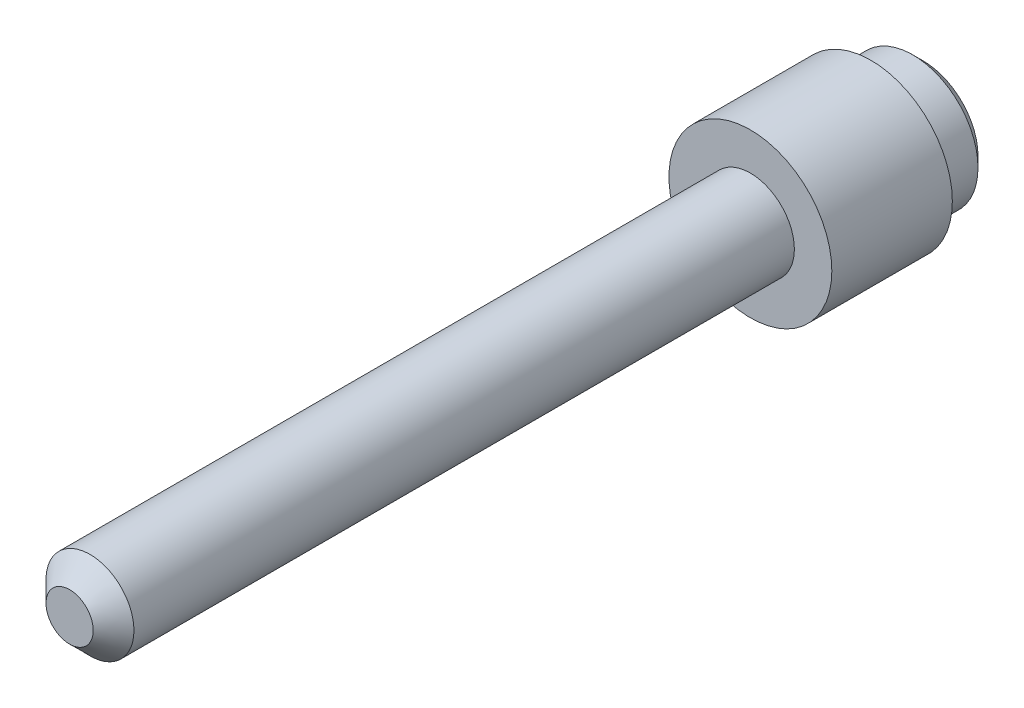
from build123d import *


with BuildPart() as part:
    # Sketch 1 → Revolve 1 (revolve)
    with BuildSketch(Plane(origin=(0, 0, 0), x_dir=(0, 0, -1), z_dir=(1, 0, 0)), mode=Mode.PRIVATE) as revolve_1_sk:
        Polygon((0, 0), (0, 0.92075), (0.79375, 1.7145), (26.543, 1.7145), (26.543, 3.175), (31.242, 3.175), (31.242, 2.54), (32.877125, 2.54), (33.274, 2.143125), (33.274, 0), align=None)
    revolve(revolve_1_sk.sketch.rotate(Axis((0, 0, 0), (0, 0, -1)), 90), axis=Axis((0, 0, 0), (0, 0, -1)))


solid = part.part
